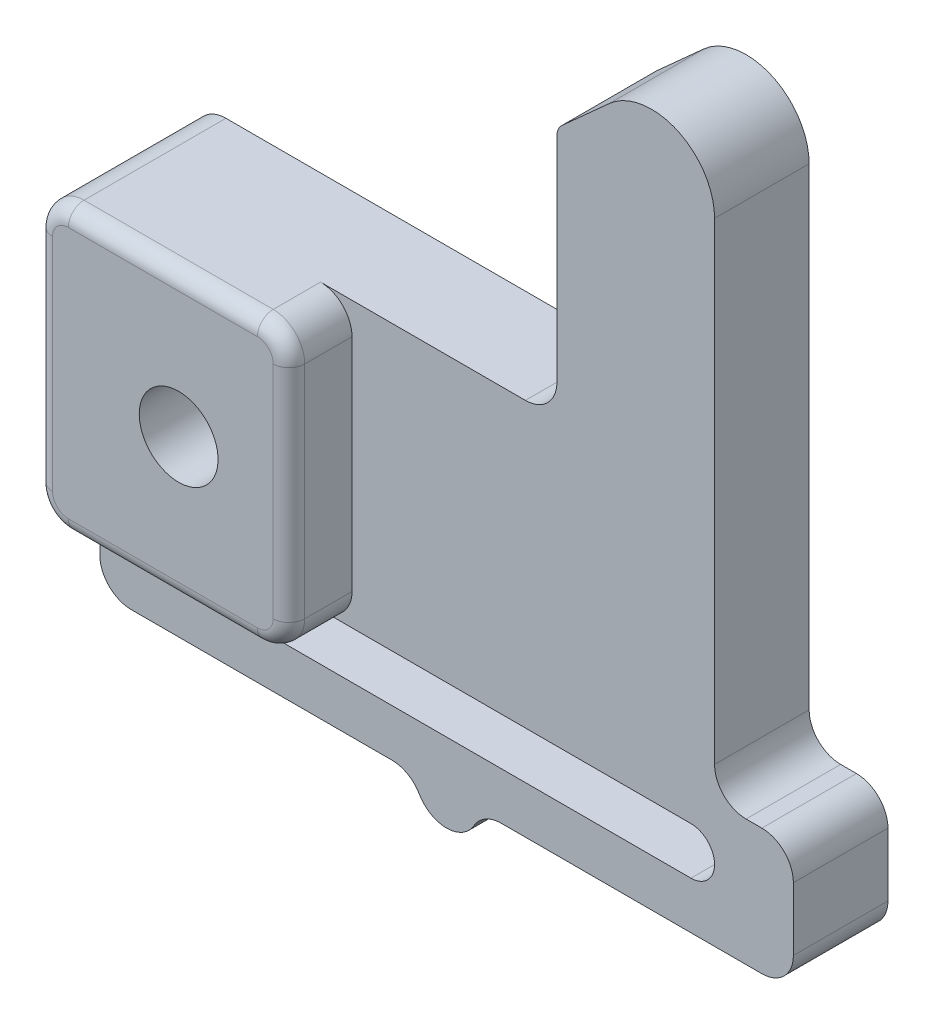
from build123d import *

# Parameters (mm, degrees)
EXTRUSION1_DEPTH        = 3
EXTRUSION2_DEPTH        = 2
ENL_V_MAT_EXTRU_1_DEPTH = 32.256999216
ESQUISSE4_W             = 5
ESQUISSE4_H             = 5
ENL_V_MAT_EXTRU_2_DEPTH = 3
CONG_1_R                = 0.5
ESQUISSE5_R             = 1.25
ENL_V_MAT_EXTRU_3_DEPTH = 32.256999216


with BuildPart() as part:
    # Esquisse1 → Extrusion1 (new body)
    with BuildSketch(Plane.XY):
        with BuildLine():
            Line((1, 0), (9.267949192, 0))
            ThreePointArc((9.267949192, 0), (9.767949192, -0.133974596), (10.133974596, -0.5))
            ThreePointArc((10.133974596, -0.5), (11, -1), (11.866025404, -0.5))
            ThreePointArc((11.866025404, -0.5), (12.232050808, -0.133974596), (12.732050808, 0))
            Line((12.732050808, 0), (19.5, 0))
            Line((19.5, 0), (21, 0))
            ThreePointArc((21, 0), (21.707106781, 0.292893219), (22, 1))
            Line((22, 1), (22, 3))
            ThreePointArc((22, 3), (21.707106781, 3.707106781), (21, 4))
            Line((21, 4), (20.5, 4))
            ThreePointArc((20.5, 4), (19.792893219, 4.292893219), (19.5, 5))
            Line((19.5, 5), (19.5, 20))
            ThreePointArc((19.5, 20), (18.313473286, 21.827090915), (16.161738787, 21.486289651))
            Line((16.161738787, 21.486289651), (14.665434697, 20.139011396))
            ThreePointArc((14.665434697, 20.139011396), (14.543227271, 19.970807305), (14.5, 19.767438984))
            Line((14.5, 19.767438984), (14.5, 13))
            ThreePointArc((14.5, 13), (14.207106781, 12.292893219), (13.5, 12))
            Line((13.5, 12), (1, 12))
            ThreePointArc((1, 12), (0.292893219, 11.707106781), (0, 11))
            Line((0, 11), (0, 1))
            ThreePointArc((0, 1), (0.292893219, 0.292893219), (1, 0))
        make_face()
    extrude(amount=EXTRUSION1_DEPTH)

    # Esquisse2 → Extrusion2 (add)
    with BuildSketch(Plane.XY.offset(3)):
        with BuildLine():
            Line((7, 12), (1, 12))
            ThreePointArc((1, 12), (0.292893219, 11.707106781), (0, 11))
            Line((0, 11), (0, 4))
            ThreePointArc((0, 4), (0.292893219, 3.292893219), (1, 3))
            Line((1, 3), (7, 3))
            ThreePointArc((7, 3), (7.707106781, 3.292893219), (8, 4))
            Line((8, 4), (8, 11))
            ThreePointArc((8, 11), (7.707106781, 11.707106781), (7, 12))
        make_face()
    extrude(amount=EXTRUSION2_DEPTH)

    # Esquisse3 → Enl_v. mat.-Extru.1 (cut, through all)
    with BuildSketch(Plane.XY.offset(3)):
        with BuildLine():
            Line((3.25, 3), (18.75, 3))
            ThreePointArc((18.75, 3), (19.5, 2.25), (18.75, 1.5))
            Line((18.75, 1.5), (3.25, 1.5))
            ThreePointArc((3.25, 1.5), (2.5, 2.25), (3.25, 3))
        make_face()
    extrude(amount=-ENL_V_MAT_EXTRU_1_DEPTH, mode=Mode.SUBTRACT)

    # Esquisse4 → Enl_v. mat.-Extru.2 (cut)
    with BuildSketch(Plane(origin=(0, 0, 0), x_dir=(-1, 0, 0), z_dir=(0, 0, -1))):
        with Locations((-4.5, 7.5)):
            Rectangle(ESQUISSE4_W, ESQUISSE4_H)
    extrude(amount=-ENL_V_MAT_EXTRU_2_DEPTH, mode=Mode.SUBTRACT)

    # Cong_1
    cong_1_edges = [part.edges().sort_by_distance(p)[0] for p in [
        (8, 7.5, 5),
        (7.707106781, 3.292893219, 5),
        (4, 3, 5),
        (0.292893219, 3.292893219, 5),
        (0, 7.5, 5),
        (0.292893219, 11.707106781, 5),
        (4, 12, 5),
        (7.707106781, 11.707106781, 5),
    ]]
    fillet(cong_1_edges, radius=CONG_1_R)

    # Esquisse5 → Enl_v. mat.-Extru.3 (cut, through all)
    with BuildSketch(Plane(origin=(0, 0, 3), x_dir=(-1, 0, 0), z_dir=(0, 0, -1))):
        with Locations((-4.5, 7.5)):
            Circle(ESQUISSE5_R)
    extrude(amount=-ENL_V_MAT_EXTRU_3_DEPTH, mode=Mode.SUBTRACT)


solid = part.part
